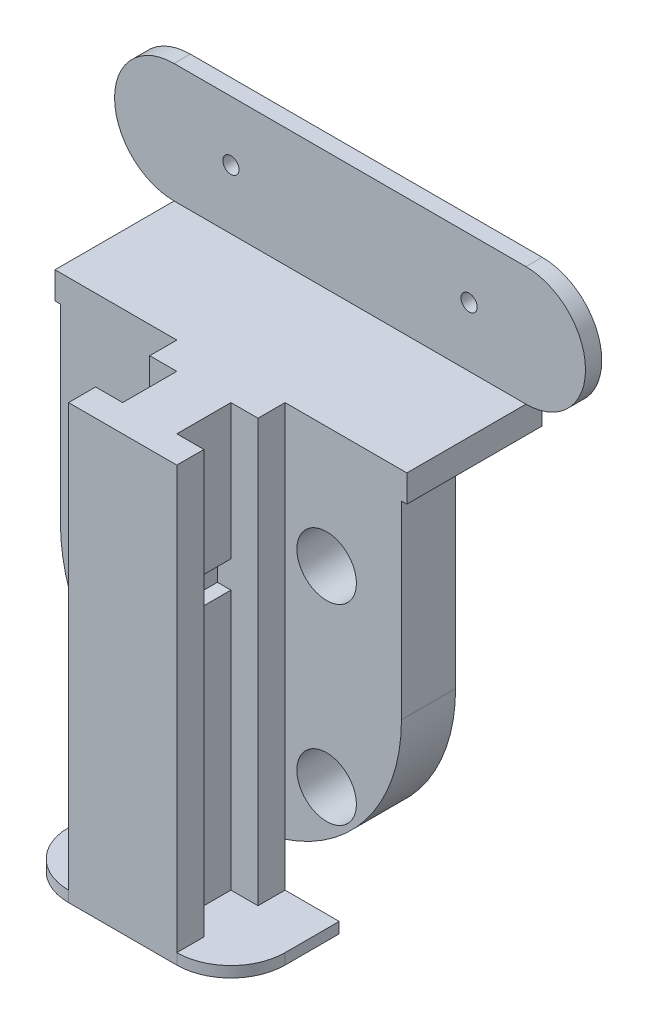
from build123d import *

# Parameters (mm, degrees)
SKETCH1_R                = 5.5
BOSS_EXTRUDE1_DEPTH      = 10
SKETCH1_3_R              = 5.5
SKETCH1_3_R_2            = 2.5
BOSS_EXTRUDE2_DEPTH      = 2
SKETCH1_4_R              = 2.5
BOSS_EXTRUDE3_DEPTH      = 5
BOSS_EXTRUDE4_DEPTH      = 5
SKETCH4_W                = 20
SKETCH4_H                = 80
BOSS_EXTRUDE5_DEPTH      = 20
BOSS_EXTRUDE6_DEPTH      = 10
BOSS_EXTRUDE6_DEPTH_BACK = 30
SKETCH5_W                = 20
SKETCH5_H                = 2
SKETCH7_W                = 5
SKETCH7_H                = 10
CUT_EXTRUDE1_DEPTH       = 78
FILLET1_R                = 10
SKETCH9_W                = 10
SKETCH9_H                = 5
CUT_EXTRUDE2_DEPTH       = 2.5
SKETCH14_R               = 1.5
BOSS_EXTRUDE8_DEPTH      = 3
SKETCH16_W               = 10
SKETCH16_H               = 5
CUT_EXTRUDE4_DEPTH       = 2.5


with BuildPart() as part:
    # Sketch1 → Boss-Extrude1 (new body)
    with BuildSketch(Plane.XY):
        with BuildLine():
            Line((31.5, 0), (31.5, 40))
            Line((31.5, 40), (-31.5, 40))
            Line((-31.5, 40), (-31.5, 0))
            ThreePointArc((-31.5, 0), (0, -31.5), (31.5, 0))
        make_face()
        with Locations((17.67766953, -17.67766953)):
            Circle(SKETCH1_R, mode=Mode.SUBTRACT)
        with Locations((-17.67766953, -17.67766953)):
            Circle(SKETCH1_R, mode=Mode.SUBTRACT)
        with Locations((-17.67766953, 17.67766953)):
            Circle(SKETCH1_R, mode=Mode.SUBTRACT)
        with Locations((17.67766953, 17.67766953)):
            Circle(SKETCH1_R, mode=Mode.SUBTRACT)
    extrude(amount=BOSS_EXTRUDE1_DEPTH)

    # Sketch1_3 → Boss-Extrude2 (add)
    # profile 1 of 4: a face of its own
    with BuildSketch(Plane.XY):
        with Locations((17.67766953, 17.67766953)):
            Circle(SKETCH1_3_R)
        with Locations((17.67766953, 17.67766953)):
            Circle(SKETCH1_3_R_2, mode=Mode.SUBTRACT)
    # profile 2 of 4: a face of its own
    with BuildSketch(Plane.XY):
        with Locations((17.67766953, -17.67766953)):
            Circle(SKETCH1_3_R)
        with Locations((17.67766953, -17.67766953)):
            Circle(SKETCH1_3_R_2, mode=Mode.SUBTRACT)
    # profile 3 of 4: a face of its own
    with BuildSketch(Plane.XY):
        with Locations((-17.67766953, -17.67766953)):
            Circle(SKETCH1_3_R)
        with Locations((-17.67766953, -17.67766953)):
            Circle(SKETCH1_3_R_2, mode=Mode.SUBTRACT)
    # profile 4 of 4: a face of its own
    with BuildSketch(Plane.XY):
        with Locations((-17.67766953, 17.67766953)):
            Circle(SKETCH1_3_R)
        with Locations((-17.67766953, 17.67766953)):
            Circle(SKETCH1_3_R_2, mode=Mode.SUBTRACT)
    extrude(amount=BOSS_EXTRUDE2_DEPTH)

    # Sketch1_4 → Boss-Extrude3 (add)
    with BuildSketch(Plane.XY):
        with Locations((0, 25)):
            Circle(SKETCH1_4_R)
    extrude(amount=-BOSS_EXTRUDE3_DEPTH)

    # Sketch2 → Boss-Extrude4 (add)
    with BuildSketch(Plane(origin=(0, 40, 0), x_dir=(1, 0, 0), z_dir=(0, 1, 0))):
        Polygon((-32.5, -10), (31.5, -10), (32.5, -10), (32.5, 15), (-32.5, 15), align=None)
    extrude(amount=-BOSS_EXTRUDE4_DEPTH)

    # Sketch4 → Boss-Extrude5 (add)
    with BuildSketch(Plane.XY.offset(10)):
        Rectangle(SKETCH4_W, SKETCH4_H)
    extrude(amount=BOSS_EXTRUDE5_DEPTH)

    # Sketch5 → Boss-Extrude6 (add, two sides: drawn at the far end of the back side and taken through both)
    with BuildSketch(Plane(origin=(10, 0, 0), x_dir=(0, 0, -1), z_dir=(1, 0, 0)).offset(-BOSS_EXTRUDE6_DEPTH_BACK)):
        with Locations((-20, -39)):
            Rectangle(SKETCH5_W, SKETCH5_H)
    extrude(amount=BOSS_EXTRUDE6_DEPTH + BOSS_EXTRUDE6_DEPTH_BACK)

    # Sketch7 → Cut-Extrude1 (cut)
    with BuildSketch(Plane(origin=(0, 40, 0), x_dir=(1, 0, 0), z_dir=(0, 1, 0))):
        with Locations((-7.5, -20)):
            Rectangle(SKETCH7_W, SKETCH7_H)
        with Locations((7.5, -20)):
            Rectangle(SKETCH7_W, SKETCH7_H)
    extrude(amount=-CUT_EXTRUDE1_DEPTH, mode=Mode.SUBTRACT)

    # Fillet1
    fillet1_edges = [part.edges().sort_by_distance(p)[0] for p in [
        (-20, -39, 30),
        (20, -39, 30),
    ]]
    fillet(fillet1_edges, radius=FILLET1_R)

    # Sketch9 → Cut-Extrude2 (cut)
    with BuildSketch(Plane(origin=(5, 0, 0), x_dir=(0, 0, -1), z_dir=(1, 0, 0))):
        with Locations((-20, 12.5)):
            Rectangle(SKETCH9_W, SKETCH9_H)
    extrude(amount=-CUT_EXTRUDE2_DEPTH, mode=Mode.SUBTRACT)

    # Sketch14 → Boss-Extrude8 (add)
    with BuildSketch(Plane(origin=(0, 0, -15), x_dir=(-1, 0, 0), z_dir=(0, 0, -1))):
        with BuildLine():
            Line((32.5, 62), (-32.5, 62))
            ThreePointArc((-32.5, 62), (-43.5, 51), (-32.5, 40))
            Line((-32.5, 40), (32.5, 40))
            ThreePointArc((32.5, 40), (43.5, 51), (32.5, 62))
        make_face()
        with Locations((-22, 51)):
            Circle(SKETCH14_R, mode=Mode.SUBTRACT)
        with Locations((22, 51)):
            Circle(SKETCH14_R, mode=Mode.SUBTRACT)
    extrude(amount=-BOSS_EXTRUDE8_DEPTH)

    # Sketch16 → Cut-Extrude4 (cut)
    with BuildSketch(Plane.ZY.offset(5)):
        with Locations((20, 12.5)):
            Rectangle(SKETCH16_W, SKETCH16_H)
    extrude(amount=-CUT_EXTRUDE4_DEPTH, mode=Mode.SUBTRACT)


solid = part.part
